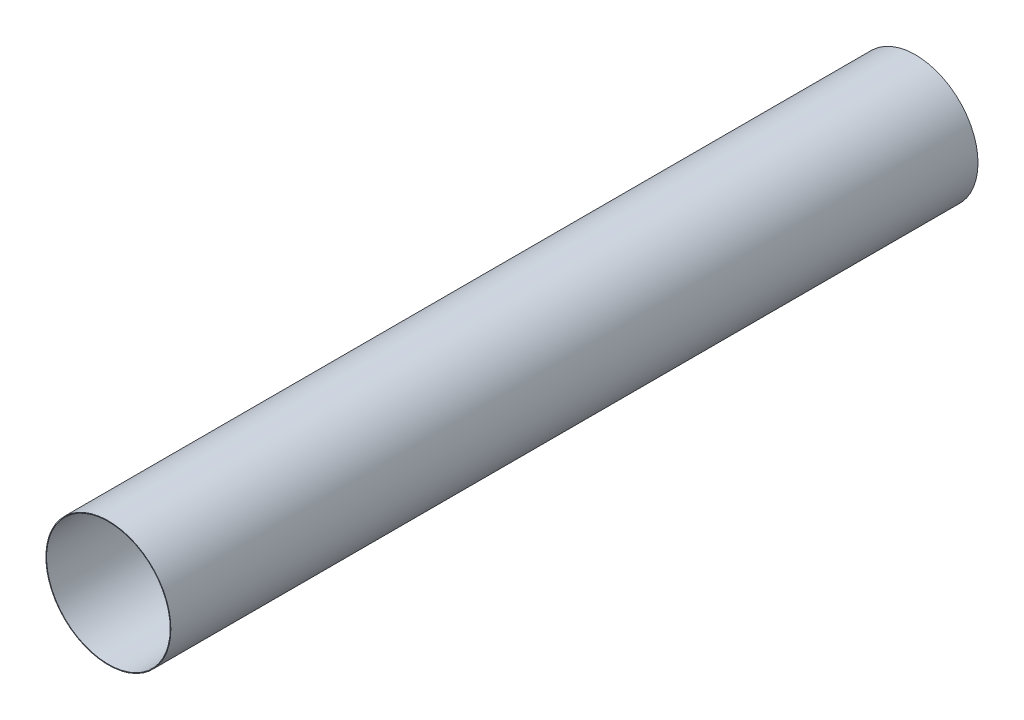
from build123d import *

# Parameters (mm, degrees)
SKETCH1_R           = 19.2
SKETCH1_R_2         = 19
BOSS_EXTRUDE1_DEPTH = 248


with BuildPart() as part:
    # Sketch1 → Boss-Extrude1 (new body)
    with BuildSketch(Plane.XY):
        Circle(SKETCH1_R)
        Circle(SKETCH1_R_2, mode=Mode.SUBTRACT)
    extrude(amount=-BOSS_EXTRUDE1_DEPTH)


solid = part.part
